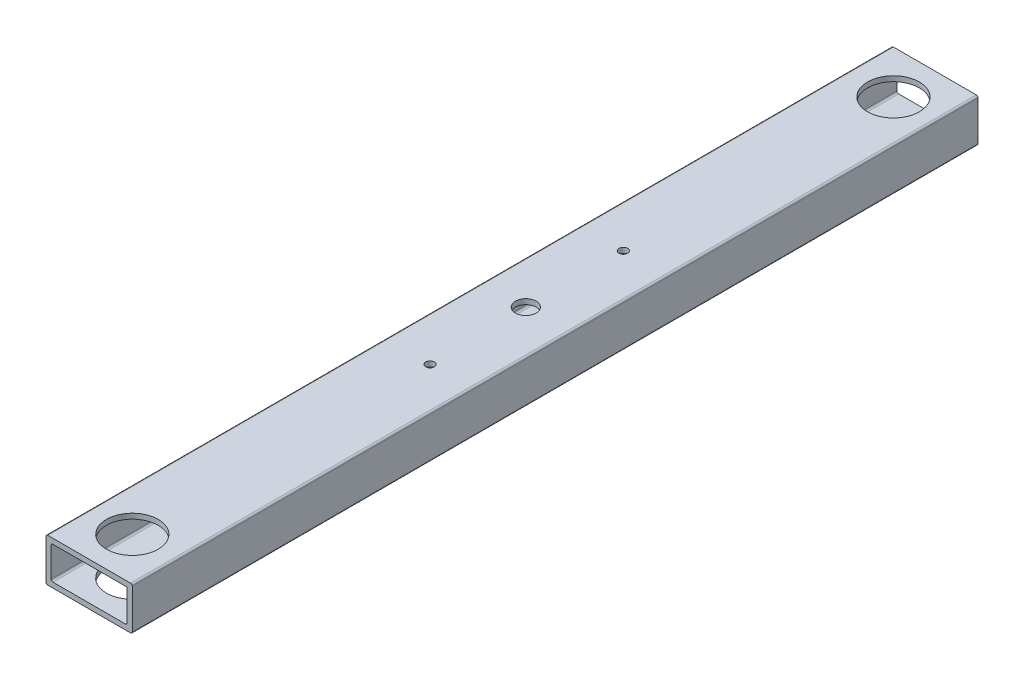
ISO-10303-21;
HEADER;
FILE_DESCRIPTION(('STEP AP214'),'2;1');
FILE_NAME('part.step','',(''),(''),'','','');
FILE_SCHEMA(('AUTOMOTIVE_DESIGN { 1 0 10303 214 1 1 1 1 }'));
ENDSEC;
DATA;
#1=APPLICATION_CONTEXT('core data for automotive mechanical design processes');
#2=APPLICATION_PROTOCOL_DEFINITION('international standard','automotive_design',2000,#1);
#3=PRODUCT_CONTEXT('',#1,'mechanical');
#4=PRODUCT('Part','Part','',(#3));
#5=PRODUCT_RELATED_PRODUCT_CATEGORY('part','',(#4));
#6=PRODUCT_DEFINITION_FORMATION('','',#4);
#7=PRODUCT_DEFINITION_CONTEXT('part definition',#1,'design');
#8=PRODUCT_DEFINITION('design','',#6,#7);
#9=PRODUCT_DEFINITION_SHAPE('','',#8);
#10=(LENGTH_UNIT() NAMED_UNIT(*) SI_UNIT(.MILLI.,.METRE.));
#11=(NAMED_UNIT(*) PLANE_ANGLE_UNIT() SI_UNIT($,.RADIAN.));
#12=(NAMED_UNIT(*) SI_UNIT($,.STERADIAN.) SOLID_ANGLE_UNIT());
#13=UNCERTAINTY_MEASURE_WITH_UNIT(LENGTH_MEASURE(1.E-05),#10,'distance_accuracy_value','');
#14=(GEOMETRIC_REPRESENTATION_CONTEXT(3) GLOBAL_UNCERTAINTY_ASSIGNED_CONTEXT((#13)) GLOBAL_UNIT_ASSIGNED_CONTEXT((#10,
#11,#12)) REPRESENTATION_CONTEXT('',''));
#15=CARTESIAN_POINT('',(0.,0.,0.));
#16=DIRECTION('',(0.,0.,1.));
#17=DIRECTION('',(1.,0.,0.));
#18=AXIS2_PLACEMENT_3D('',#15,#16,#17);
#19=CARTESIAN_POINT('',(1.,24.,490.));
#20=DIRECTION('',(0.,0.,-1.));
#21=DIRECTION('',(-1.,0.,0.));
#22=AXIS2_PLACEMENT_3D('',#19,#20,#21);
#23=PLANE('',#22);
#24=CARTESIAN_POINT('',(1.,24.,490.));
#25=DIRECTION('',(0.,0.,1.));
#26=DIRECTION('',(-1.,0.,0.));
#27=AXIS2_PLACEMENT_3D('',#24,#25,#26);
#28=CIRCLE('',#27,0.999999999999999);
#29=CARTESIAN_POINT('',(1.,25.,490.));
#30=VERTEX_POINT('',#29);
#31=CARTESIAN_POINT('',(0.,24.,490.));
#32=VERTEX_POINT('',#31);
#33=EDGE_CURVE('E218',#30,#32,#28,.T.);
#34=ORIENTED_EDGE('',*,*,#33,.T.);
#35=DIRECTION('',(0.,-1.,0.));
#36=VECTOR('',#35,1.);
#37=CARTESIAN_POINT('',(0.,1.,490.));
#38=LINE('',#37,#36);
#39=CARTESIAN_POINT('',(0.,1.,490.));
#40=VERTEX_POINT('',#39);
#41=EDGE_CURVE('E221',#32,#40,#38,.T.);
#42=ORIENTED_EDGE('',*,*,#41,.T.);
#43=CARTESIAN_POINT('',(1.,1.,490.));
#44=DIRECTION('',(0.,0.,1.));
#45=DIRECTION('',(-1.,0.,0.));
#46=AXIS2_PLACEMENT_3D('',#43,#44,#45);
#47=CIRCLE('',#46,1.);
#48=CARTESIAN_POINT('',(1.,0.,490.));
#49=VERTEX_POINT('',#48);
#50=EDGE_CURVE('E223',#40,#49,#47,.T.);
#51=ORIENTED_EDGE('',*,*,#50,.T.);
#52=DIRECTION('',(1.,0.,0.));
#53=VECTOR('',#52,1.);
#54=CARTESIAN_POINT('',(1.,0.,490.));
#55=LINE('',#54,#53);
#56=CARTESIAN_POINT('',(49.,0.,490.));
#57=VERTEX_POINT('',#56);
#58=EDGE_CURVE('E225',#49,#57,#55,.T.);
#59=ORIENTED_EDGE('',*,*,#58,.T.);
#60=CARTESIAN_POINT('',(49.,1.,490.));
#61=DIRECTION('',(0.,0.,1.));
#62=DIRECTION('',(1.,0.,0.));
#63=AXIS2_PLACEMENT_3D('',#60,#61,#62);
#64=CIRCLE('',#63,1.);
#65=CARTESIAN_POINT('',(50.,1.,490.));
#66=VERTEX_POINT('',#65);
#67=EDGE_CURVE('E227',#57,#66,#64,.T.);
#68=ORIENTED_EDGE('',*,*,#67,.T.);
#69=DIRECTION('',(0.,1.,0.));
#70=VECTOR('',#69,1.);
#71=CARTESIAN_POINT('',(50.,1.,490.));
#72=LINE('',#71,#70);
#73=CARTESIAN_POINT('',(50.,24.,490.));
#74=VERTEX_POINT('',#73);
#75=EDGE_CURVE('E229',#66,#74,#72,.T.);
#76=ORIENTED_EDGE('',*,*,#75,.T.);
#77=CARTESIAN_POINT('',(49.,24.,490.));
#78=DIRECTION('',(0.,0.,1.));
#79=DIRECTION('',(1.,0.,0.));
#80=AXIS2_PLACEMENT_3D('',#77,#78,#79);
#81=CIRCLE('',#80,0.999999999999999);
#82=CARTESIAN_POINT('',(49.,25.,490.));
#83=VERTEX_POINT('',#82);
#84=EDGE_CURVE('E231',#74,#83,#81,.T.);
#85=ORIENTED_EDGE('',*,*,#84,.T.);
#86=DIRECTION('',(-1.,0.,0.));
#87=VECTOR('',#86,1.);
#88=CARTESIAN_POINT('',(1.,25.,490.));
#89=LINE('',#88,#87);
#90=EDGE_CURVE('E233',#83,#30,#89,.T.);
#91=ORIENTED_EDGE('',*,*,#90,.T.);
#92=EDGE_LOOP('',(#34,#42,#51,#59,#68,#76,#85,#91));
#93=FACE_BOUND('',#92,.T.);
#94=DIRECTION('',(0.,1.,0.));
#95=VECTOR('',#94,1.);
#96=CARTESIAN_POINT('',(47.,4.,490.));
#97=LINE('',#96,#95);
#98=CARTESIAN_POINT('',(47.,4.,490.));
#99=VERTEX_POINT('',#98);
#100=CARTESIAN_POINT('',(47.,22.,490.));
#101=VERTEX_POINT('',#100);
#102=EDGE_CURVE('E155',#99,#101,#97,.T.);
#103=ORIENTED_EDGE('',*,*,#102,.F.);
#104=CARTESIAN_POINT('',(46.,4.,490.));
#105=DIRECTION('',(0.,0.,1.));
#106=DIRECTION('',(-1.,0.,0.));
#107=AXIS2_PLACEMENT_3D('',#104,#105,#106);
#108=CIRCLE('',#107,1.);
#109=CARTESIAN_POINT('',(46.,3.,490.));
#110=VERTEX_POINT('',#109);
#111=EDGE_CURVE('E190',#110,#99,#108,.T.);
#112=ORIENTED_EDGE('',*,*,#111,.F.);
#113=DIRECTION('',(1.,0.,0.));
#114=VECTOR('',#113,1.);
#115=CARTESIAN_POINT('',(4.,3.,490.));
#116=LINE('',#115,#114);
#117=CARTESIAN_POINT('',(4.,3.,490.));
#118=VERTEX_POINT('',#117);
#119=EDGE_CURVE('E188',#118,#110,#116,.T.);
#120=ORIENTED_EDGE('',*,*,#119,.F.);
#121=CARTESIAN_POINT('',(4.,4.,490.));
#122=DIRECTION('',(0.,0.,1.));
#123=DIRECTION('',(-1.,0.,0.));
#124=AXIS2_PLACEMENT_3D('',#121,#122,#123);
#125=CIRCLE('',#124,1.);
#126=CARTESIAN_POINT('',(3.,4.,490.));
#127=VERTEX_POINT('',#126);
#128=EDGE_CURVE('E186',#127,#118,#125,.T.);
#129=ORIENTED_EDGE('',*,*,#128,.F.);
#130=DIRECTION('',(0.,-1.,0.));
#131=VECTOR('',#130,1.);
#132=CARTESIAN_POINT('',(3.,4.,490.));
#133=LINE('',#132,#131);
#134=CARTESIAN_POINT('',(3.,21.,490.));
#135=VERTEX_POINT('',#134);
#136=EDGE_CURVE('E184',#135,#127,#133,.T.);
#137=ORIENTED_EDGE('',*,*,#136,.F.);
#138=CARTESIAN_POINT('',(4.,21.,490.));
#139=DIRECTION('',(0.,0.,1.));
#140=DIRECTION('',(-1.,0.,0.));
#141=AXIS2_PLACEMENT_3D('',#138,#139,#140);
#142=CIRCLE('',#141,1.);
#143=CARTESIAN_POINT('',(4.,22.,490.));
#144=VERTEX_POINT('',#143);
#145=EDGE_CURVE('E182',#144,#135,#142,.T.);
#146=ORIENTED_EDGE('',*,*,#145,.F.);
#147=DIRECTION('',(-1.,0.,0.));
#148=VECTOR('',#147,1.);
#149=CARTESIAN_POINT('',(4.,22.,490.));
#150=LINE('',#149,#148);
#151=EDGE_CURVE('E180',#101,#144,#150,.T.);
#152=ORIENTED_EDGE('',*,*,#151,.F.);
#153=EDGE_LOOP('',(#103,#112,#120,#129,#137,#146,#152));
#154=FACE_BOUND('',#153,.T.);
#155=ADVANCED_FACE('F31',(#93,#154),#23,.F.);
#156=CARTESIAN_POINT('',(1.,24.,0.));
#157=DIRECTION('',(0.,0.,-1.));
#158=DIRECTION('',(-1.,0.,0.));
#159=AXIS2_PLACEMENT_3D('',#156,#157,#158);
#160=PLANE('',#159);
#161=CARTESIAN_POINT('',(1.,24.,0.));
#162=DIRECTION('',(0.,0.,1.));
#163=DIRECTION('',(-1.,0.,0.));
#164=AXIS2_PLACEMENT_3D('',#161,#162,#163);
#165=CIRCLE('',#164,0.999999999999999);
#166=CARTESIAN_POINT('',(1.,25.,0.));
#167=VERTEX_POINT('',#166);
#168=CARTESIAN_POINT('',(0.,24.,0.));
#169=VERTEX_POINT('',#168);
#170=EDGE_CURVE('E156',#167,#169,#165,.T.);
#171=ORIENTED_EDGE('',*,*,#170,.F.);
#172=DIRECTION('',(-1.,0.,0.));
#173=VECTOR('',#172,1.);
#174=CARTESIAN_POINT('',(1.,25.,0.));
#175=LINE('',#174,#173);
#176=CARTESIAN_POINT('',(49.,25.,0.));
#177=VERTEX_POINT('',#176);
#178=EDGE_CURVE('E216',#177,#167,#175,.T.);
#179=ORIENTED_EDGE('',*,*,#178,.F.);
#180=CARTESIAN_POINT('',(49.,24.,0.));
#181=DIRECTION('',(0.,0.,1.));
#182=DIRECTION('',(1.,0.,0.));
#183=AXIS2_PLACEMENT_3D('',#180,#181,#182);
#184=CIRCLE('',#183,0.999999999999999);
#185=CARTESIAN_POINT('',(50.,24.,0.));
#186=VERTEX_POINT('',#185);
#187=EDGE_CURVE('E214',#186,#177,#184,.T.);
#188=ORIENTED_EDGE('',*,*,#187,.F.);
#189=DIRECTION('',(0.,1.,0.));
#190=VECTOR('',#189,1.);
#191=CARTESIAN_POINT('',(50.,1.,0.));
#192=LINE('',#191,#190);
#193=CARTESIAN_POINT('',(50.,1.,0.));
#194=VERTEX_POINT('',#193);
#195=EDGE_CURVE('E212',#194,#186,#192,.T.);
#196=ORIENTED_EDGE('',*,*,#195,.F.);
#197=CARTESIAN_POINT('',(49.,1.,0.));
#198=DIRECTION('',(0.,0.,1.));
#199=DIRECTION('',(1.,0.,0.));
#200=AXIS2_PLACEMENT_3D('',#197,#198,#199);
#201=CIRCLE('',#200,1.);
#202=CARTESIAN_POINT('',(49.,0.,0.));
#203=VERTEX_POINT('',#202);
#204=EDGE_CURVE('E210',#203,#194,#201,.T.);
#205=ORIENTED_EDGE('',*,*,#204,.F.);
#206=DIRECTION('',(1.,0.,0.));
#207=VECTOR('',#206,1.);
#208=CARTESIAN_POINT('',(1.,0.,0.));
#209=LINE('',#208,#207);
#210=CARTESIAN_POINT('',(1.,0.,0.));
#211=VERTEX_POINT('',#210);
#212=EDGE_CURVE('E208',#211,#203,#209,.T.);
#213=ORIENTED_EDGE('',*,*,#212,.F.);
#214=CARTESIAN_POINT('',(1.,1.,0.));
#215=DIRECTION('',(0.,0.,1.));
#216=DIRECTION('',(-1.,0.,0.));
#217=AXIS2_PLACEMENT_3D('',#214,#215,#216);
#218=CIRCLE('',#217,1.);
#219=CARTESIAN_POINT('',(0.,1.,0.));
#220=VERTEX_POINT('',#219);
#221=EDGE_CURVE('E206',#220,#211,#218,.T.);
#222=ORIENTED_EDGE('',*,*,#221,.F.);
#223=DIRECTION('',(0.,-1.,0.));
#224=VECTOR('',#223,1.);
#225=CARTESIAN_POINT('',(0.,1.,0.));
#226=LINE('',#225,#224);
#227=EDGE_CURVE('E204',#169,#220,#226,.T.);
#228=ORIENTED_EDGE('',*,*,#227,.F.);
#229=EDGE_LOOP('',(#171,#179,#188,#196,#205,#213,#222,#228));
#230=FACE_BOUND('',#229,.T.);
#231=CARTESIAN_POINT('',(46.,4.,0.));
#232=DIRECTION('',(0.,0.,1.));
#233=DIRECTION('',(-1.,0.,0.));
#234=AXIS2_PLACEMENT_3D('',#231,#232,#233);
#235=CIRCLE('',#234,1.);
#236=CARTESIAN_POINT('',(46.,3.,0.));
#237=VERTEX_POINT('',#236);
#238=CARTESIAN_POINT('',(47.,4.,0.));
#239=VERTEX_POINT('',#238);
#240=EDGE_CURVE('E161',#237,#239,#235,.T.);
#241=ORIENTED_EDGE('',*,*,#240,.T.);
#242=DIRECTION('',(0.,1.,0.));
#243=VECTOR('',#242,1.);
#244=CARTESIAN_POINT('',(47.,4.,0.));
#245=LINE('',#244,#243);
#246=CARTESIAN_POINT('',(47.,22.,0.));
#247=VERTEX_POINT('',#246);
#248=EDGE_CURVE('E56',#239,#247,#245,.T.);
#249=ORIENTED_EDGE('',*,*,#248,.T.);
#250=DIRECTION('',(-1.,0.,0.));
#251=VECTOR('',#250,1.);
#252=CARTESIAN_POINT('',(4.,22.,0.));
#253=LINE('',#252,#251);
#254=CARTESIAN_POINT('',(4.,22.,0.));
#255=VERTEX_POINT('',#254);
#256=EDGE_CURVE('E142',#247,#255,#253,.T.);
#257=ORIENTED_EDGE('',*,*,#256,.T.);
#258=CARTESIAN_POINT('',(4.,21.,0.));
#259=DIRECTION('',(0.,0.,1.));
#260=DIRECTION('',(-1.,0.,0.));
#261=AXIS2_PLACEMENT_3D('',#258,#259,#260);
#262=CIRCLE('',#261,1.);
#263=CARTESIAN_POINT('',(3.,21.,0.));
#264=VERTEX_POINT('',#263);
#265=EDGE_CURVE('E151',#255,#264,#262,.T.);
#266=ORIENTED_EDGE('',*,*,#265,.T.);
#267=DIRECTION('',(0.,-1.,0.));
#268=VECTOR('',#267,1.);
#269=CARTESIAN_POINT('',(3.,4.,0.));
#270=LINE('',#269,#268);
#271=CARTESIAN_POINT('',(3.,4.,0.));
#272=VERTEX_POINT('',#271);
#273=EDGE_CURVE('E170',#264,#272,#270,.T.);
#274=ORIENTED_EDGE('',*,*,#273,.T.);
#275=CARTESIAN_POINT('',(4.,4.,0.));
#276=DIRECTION('',(0.,0.,1.));
#277=DIRECTION('',(-1.,0.,0.));
#278=AXIS2_PLACEMENT_3D('',#275,#276,#277);
#279=CIRCLE('',#278,1.);
#280=CARTESIAN_POINT('',(4.,3.,0.));
#281=VERTEX_POINT('',#280);
#282=EDGE_CURVE('E173',#272,#281,#279,.T.);
#283=ORIENTED_EDGE('',*,*,#282,.T.);
#284=DIRECTION('',(1.,0.,0.));
#285=VECTOR('',#284,1.);
#286=CARTESIAN_POINT('',(4.,3.,0.));
#287=LINE('',#286,#285);
#288=EDGE_CURVE('E176',#281,#237,#287,.T.);
#289=ORIENTED_EDGE('',*,*,#288,.T.);
#290=EDGE_LOOP('',(#241,#249,#257,#266,#274,#283,#289));
#291=FACE_BOUND('',#290,.T.);
#292=ADVANCED_FACE('F159',(#230,#291),#160,.T.);
#293=CARTESIAN_POINT('',(1.,24.,490.));
#294=DIRECTION('',(0.,0.,-1.));
#295=DIRECTION('',(-1.,0.,0.));
#296=AXIS2_PLACEMENT_3D('',#293,#294,#295);
#297=CYLINDRICAL_SURFACE('',#296,0.999999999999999);
#298=ORIENTED_EDGE('',*,*,#170,.T.);
#299=DIRECTION('',(0.,0.,-1.));
#300=VECTOR('',#299,1.);
#301=CARTESIAN_POINT('',(0.,24.,490.));
#302=LINE('',#301,#300);
#303=EDGE_CURVE('E11',#32,#169,#302,.T.);
#304=ORIENTED_EDGE('',*,*,#303,.F.);
#305=ORIENTED_EDGE('',*,*,#33,.F.);
#306=DIRECTION('',(0.,0.,-1.));
#307=VECTOR('',#306,1.);
#308=CARTESIAN_POINT('',(1.,25.,490.));
#309=LINE('',#308,#307);
#310=EDGE_CURVE('E235',#30,#167,#309,.T.);
#311=ORIENTED_EDGE('',*,*,#310,.T.);
#312=EDGE_LOOP('',(#298,#304,#305,#311));
#313=FACE_BOUND('',#312,.T.);
#314=ADVANCED_FACE('F33',(#313),#297,.T.);
#315=CARTESIAN_POINT('',(0.,1.,490.));
#316=DIRECTION('',(1.,0.,0.));
#317=DIRECTION('',(0.,0.,-1.));
#318=AXIS2_PLACEMENT_3D('',#315,#316,#317);
#319=PLANE('',#318);
#320=ORIENTED_EDGE('',*,*,#227,.T.);
#321=DIRECTION('',(0.,0.,-1.));
#322=VECTOR('',#321,1.);
#323=CARTESIAN_POINT('',(0.,1.,490.));
#324=LINE('',#323,#322);
#325=EDGE_CURVE('E40',#40,#220,#324,.T.);
#326=ORIENTED_EDGE('',*,*,#325,.F.);
#327=ORIENTED_EDGE('',*,*,#41,.F.);
#328=ORIENTED_EDGE('',*,*,#303,.T.);
#329=EDGE_LOOP('',(#320,#326,#327,#328));
#330=FACE_BOUND('',#329,.T.);
#331=ADVANCED_FACE('F349',(#330),#319,.F.);
#332=CARTESIAN_POINT('',(1.,1.,490.));
#333=DIRECTION('',(0.,0.,-1.));
#334=DIRECTION('',(-1.,0.,0.));
#335=AXIS2_PLACEMENT_3D('',#332,#333,#334);
#336=CYLINDRICAL_SURFACE('',#335,1.);
#337=ORIENTED_EDGE('',*,*,#221,.T.);
#338=DIRECTION('',(0.,0.,-1.));
#339=VECTOR('',#338,1.);
#340=CARTESIAN_POINT('',(1.,0.,490.));
#341=LINE('',#340,#339);
#342=EDGE_CURVE('E250',#49,#211,#341,.T.);
#343=ORIENTED_EDGE('',*,*,#342,.F.);
#344=ORIENTED_EDGE('',*,*,#50,.F.);
#345=ORIENTED_EDGE('',*,*,#325,.T.);
#346=EDGE_LOOP('',(#337,#343,#344,#345));
#347=FACE_BOUND('',#346,.T.);
#348=ADVANCED_FACE('F346',(#347),#336,.T.);
#349=CARTESIAN_POINT('',(1.,0.,490.));
#350=DIRECTION('',(0.,1.,0.));
#351=DIRECTION('',(0.,0.,1.));
#352=AXIS2_PLACEMENT_3D('',#349,#350,#351);
#353=PLANE('',#352);
#354=CARTESIAN_POINT('',(25.0000000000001,0.,465.));
#355=DIRECTION('',(0.,1.,0.));
#356=DIRECTION('',(0.,0.,1.));
#357=AXIS2_PLACEMENT_3D('',#354,#355,#356);
#358=CIRCLE('',#357,15.);
#359=CARTESIAN_POINT('',(25.0000000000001,0.,480.));
#360=VERTEX_POINT('',#359);
#361=EDGE_CURVE('E266',#360,#360,#358,.T.);
#362=ORIENTED_EDGE('',*,*,#361,.T.);
#363=EDGE_LOOP('',(#362));
#364=FACE_BOUND('',#363,.T.);
#365=CARTESIAN_POINT('',(25.,0.,237.));
#366=DIRECTION('',(0.,1.,0.));
#367=DIRECTION('',(0.,0.,1.));
#368=AXIS2_PLACEMENT_3D('',#365,#366,#367);
#369=CIRCLE('',#368,6.00000000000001);
#370=CARTESIAN_POINT('',(25.,0.,243.));
#371=VERTEX_POINT('',#370);
#372=EDGE_CURVE('E262',#371,#371,#369,.T.);
#373=ORIENTED_EDGE('',*,*,#372,.T.);
#374=EDGE_LOOP('',(#373));
#375=FACE_BOUND('',#374,.T.);
#376=CARTESIAN_POINT('',(26.,0.,25.));
#377=DIRECTION('',(0.,1.,0.));
#378=DIRECTION('',(0.,0.,1.));
#379=AXIS2_PLACEMENT_3D('',#376,#377,#378);
#380=CIRCLE('',#379,15.);
#381=CARTESIAN_POINT('',(26.,0.,40.));
#382=VERTEX_POINT('',#381);
#383=EDGE_CURVE('E257',#382,#382,#380,.T.);
#384=ORIENTED_EDGE('',*,*,#383,.T.);
#385=EDGE_LOOP('',(#384));
#386=FACE_BOUND('',#385,.T.);
#387=ORIENTED_EDGE('',*,*,#212,.T.);
#388=DIRECTION('',(0.,0.,-1.));
#389=VECTOR('',#388,1.);
#390=CARTESIAN_POINT('',(49.,0.,490.));
#391=LINE('',#390,#389);
#392=EDGE_CURVE('E247',#57,#203,#391,.T.);
#393=ORIENTED_EDGE('',*,*,#392,.F.);
#394=ORIENTED_EDGE('',*,*,#58,.F.);
#395=ORIENTED_EDGE('',*,*,#342,.T.);
#396=EDGE_LOOP('',(#387,#393,#394,#395));
#397=FACE_BOUND('',#396,.T.);
#398=ADVANCED_FACE('F299',(#364,#375,#386,#397),#353,.F.);
#399=CARTESIAN_POINT('',(49.,1.,490.));
#400=DIRECTION('',(0.,0.,-1.));
#401=DIRECTION('',(-1.,0.,0.));
#402=AXIS2_PLACEMENT_3D('',#399,#400,#401);
#403=CYLINDRICAL_SURFACE('',#402,1.);
#404=ORIENTED_EDGE('',*,*,#204,.T.);
#405=DIRECTION('',(0.,0.,-1.));
#406=VECTOR('',#405,1.);
#407=CARTESIAN_POINT('',(50.,1.,490.));
#408=LINE('',#407,#406);
#409=EDGE_CURVE('E244',#66,#194,#408,.T.);
#410=ORIENTED_EDGE('',*,*,#409,.F.);
#411=ORIENTED_EDGE('',*,*,#67,.F.);
#412=ORIENTED_EDGE('',*,*,#392,.T.);
#413=EDGE_LOOP('',(#404,#410,#411,#412));
#414=FACE_BOUND('',#413,.T.);
#415=ADVANCED_FACE('F339',(#414),#403,.T.);
#416=CARTESIAN_POINT('',(50.,1.,490.));
#417=DIRECTION('',(-1.,0.,0.));
#418=DIRECTION('',(0.,0.,1.));
#419=AXIS2_PLACEMENT_3D('',#416,#417,#418);
#420=PLANE('',#419);
#421=ORIENTED_EDGE('',*,*,#195,.T.);
#422=DIRECTION('',(0.,0.,-1.));
#423=VECTOR('',#422,1.);
#424=CARTESIAN_POINT('',(50.,24.,490.));
#425=LINE('',#424,#423);
#426=EDGE_CURVE('E241',#74,#186,#425,.T.);
#427=ORIENTED_EDGE('',*,*,#426,.F.);
#428=ORIENTED_EDGE('',*,*,#75,.F.);
#429=ORIENTED_EDGE('',*,*,#409,.T.);
#430=EDGE_LOOP('',(#421,#427,#428,#429));
#431=FACE_BOUND('',#430,.T.);
#432=ADVANCED_FACE('F335',(#431),#420,.F.);
#433=CARTESIAN_POINT('',(49.,24.,490.));
#434=DIRECTION('',(0.,0.,-1.));
#435=DIRECTION('',(-1.,0.,0.));
#436=AXIS2_PLACEMENT_3D('',#433,#434,#435);
#437=CYLINDRICAL_SURFACE('',#436,0.999999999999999);
#438=ORIENTED_EDGE('',*,*,#187,.T.);
#439=DIRECTION('',(0.,0.,-1.));
#440=VECTOR('',#439,1.);
#441=CARTESIAN_POINT('',(49.,25.,490.));
#442=LINE('',#441,#440);
#443=EDGE_CURVE('E238',#83,#177,#442,.T.);
#444=ORIENTED_EDGE('',*,*,#443,.F.);
#445=ORIENTED_EDGE('',*,*,#84,.F.);
#446=ORIENTED_EDGE('',*,*,#426,.T.);
#447=EDGE_LOOP('',(#438,#444,#445,#446));
#448=FACE_BOUND('',#447,.T.);
#449=ADVANCED_FACE('F331',(#448),#437,.T.);
#450=CARTESIAN_POINT('',(1.,25.,490.));
#451=DIRECTION('',(0.,-1.,0.));
#452=DIRECTION('',(0.,0.,-1.));
#453=AXIS2_PLACEMENT_3D('',#450,#451,#452);
#454=PLANE('',#453);
#455=CARTESIAN_POINT('',(25.,25.,180.5));
#456=DIRECTION('',(0.,1.,0.));
#457=DIRECTION('',(0.,0.,1.));
#458=AXIS2_PLACEMENT_3D('',#455,#456,#457);
#459=CIRCLE('',#458,2.49999999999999);
#460=CARTESIAN_POINT('',(25.,25.,183.));
#461=VERTEX_POINT('',#460);
#462=EDGE_CURVE('E280',#461,#461,#459,.T.);
#463=ORIENTED_EDGE('',*,*,#462,.F.);
#464=EDGE_LOOP('',(#463));
#465=FACE_BOUND('',#464,.T.);
#466=CARTESIAN_POINT('',(26.,25.,293.495575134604));
#467=DIRECTION('',(0.,1.,0.));
#468=DIRECTION('',(0.,0.,1.));
#469=AXIS2_PLACEMENT_3D('',#466,#467,#468);
#470=CIRCLE('',#469,2.49999999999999);
#471=CARTESIAN_POINT('',(26.,25.,295.995575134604));
#472=VERTEX_POINT('',#471);
#473=EDGE_CURVE('E270',#472,#472,#470,.T.);
#474=ORIENTED_EDGE('',*,*,#473,.F.);
#475=EDGE_LOOP('',(#474));
#476=FACE_BOUND('',#475,.T.);
#477=CARTESIAN_POINT('',(25.0000000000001,25.,465.));
#478=DIRECTION('',(0.,1.,0.));
#479=DIRECTION('',(0.,0.,1.));
#480=AXIS2_PLACEMENT_3D('',#477,#478,#479);
#481=CIRCLE('',#480,15.);
#482=CARTESIAN_POINT('',(25.0000000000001,25.,480.));
#483=VERTEX_POINT('',#482);
#484=EDGE_CURVE('E269',#483,#483,#481,.T.);
#485=ORIENTED_EDGE('',*,*,#484,.F.);
#486=EDGE_LOOP('',(#485));
#487=FACE_BOUND('',#486,.T.);
#488=CARTESIAN_POINT('',(25.,25.,237.));
#489=DIRECTION('',(0.,1.,0.));
#490=DIRECTION('',(0.,0.,1.));
#491=AXIS2_PLACEMENT_3D('',#488,#489,#490);
#492=CIRCLE('',#491,6.00000000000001);
#493=CARTESIAN_POINT('',(25.,25.,243.));
#494=VERTEX_POINT('',#493);
#495=EDGE_CURVE('E287',#494,#494,#492,.T.);
#496=ORIENTED_EDGE('',*,*,#495,.F.);
#497=EDGE_LOOP('',(#496));
#498=FACE_BOUND('',#497,.T.);
#499=CARTESIAN_POINT('',(26.,25.,25.));
#500=DIRECTION('',(0.,1.,0.));
#501=DIRECTION('',(0.,0.,1.));
#502=AXIS2_PLACEMENT_3D('',#499,#500,#501);
#503=CIRCLE('',#502,15.);
#504=CARTESIAN_POINT('',(26.,25.,40.));
#505=VERTEX_POINT('',#504);
#506=EDGE_CURVE('E294',#505,#505,#503,.T.);
#507=ORIENTED_EDGE('',*,*,#506,.F.);
#508=EDGE_LOOP('',(#507));
#509=FACE_BOUND('',#508,.T.);
#510=ORIENTED_EDGE('',*,*,#178,.T.);
#511=ORIENTED_EDGE('',*,*,#310,.F.);
#512=ORIENTED_EDGE('',*,*,#90,.F.);
#513=ORIENTED_EDGE('',*,*,#443,.T.);
#514=EDGE_LOOP('',(#510,#511,#512,#513));
#515=FACE_BOUND('',#514,.T.);
#516=ADVANCED_FACE('F328',(#465,#476,#487,#498,#509,#515),#454,.F.);
#517=CARTESIAN_POINT('',(47.,4.,490.));
#518=DIRECTION('',(-1.,0.,0.));
#519=DIRECTION('',(0.,0.,1.));
#520=AXIS2_PLACEMENT_3D('',#517,#518,#519);
#521=PLANE('',#520);
#522=ORIENTED_EDGE('',*,*,#248,.F.);
#523=DIRECTION('',(0.,0.,-1.));
#524=VECTOR('',#523,1.);
#525=CARTESIAN_POINT('',(47.,4.,490.));
#526=LINE('',#525,#524);
#527=EDGE_CURVE('E192',#99,#239,#526,.T.);
#528=ORIENTED_EDGE('',*,*,#527,.F.);
#529=ORIENTED_EDGE('',*,*,#102,.T.);
#530=DIRECTION('',(0.,0.,-1.));
#531=VECTOR('',#530,1.);
#532=CARTESIAN_POINT('',(47.,22.,490.));
#533=LINE('',#532,#531);
#534=EDGE_CURVE('E144',#101,#247,#533,.T.);
#535=ORIENTED_EDGE('',*,*,#534,.T.);
#536=EDGE_LOOP('',(#522,#528,#529,#535));
#537=FACE_BOUND('',#536,.T.);
#538=ADVANCED_FACE('F153',(#537),#521,.T.);
#539=CARTESIAN_POINT('',(4.,22.,490.));
#540=DIRECTION('',(0.,-1.,0.));
#541=DIRECTION('',(0.,0.,-1.));
#542=AXIS2_PLACEMENT_3D('',#539,#540,#541);
#543=PLANE('',#542);
#544=CARTESIAN_POINT('',(25.,22.,180.5));
#545=DIRECTION('',(0.,-1.,0.));
#546=DIRECTION('',(0.,0.,-1.));
#547=AXIS2_PLACEMENT_3D('',#544,#545,#546);
#548=CIRCLE('',#547,2.5);
#549=CARTESIAN_POINT('',(25.,22.,178.));
#550=VERTEX_POINT('',#549);
#551=EDGE_CURVE('E35',#550,#550,#548,.T.);
#552=ORIENTED_EDGE('',*,*,#551,.F.);
#553=EDGE_LOOP('',(#552));
#554=FACE_BOUND('',#553,.T.);
#555=CARTESIAN_POINT('',(26.,22.,293.495575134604));
#556=DIRECTION('',(0.,-1.,0.));
#557=DIRECTION('',(0.,0.,-1.));
#558=AXIS2_PLACEMENT_3D('',#555,#556,#557);
#559=CIRCLE('',#558,2.49999999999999);
#560=CARTESIAN_POINT('',(26.,22.,290.995575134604));
#561=VERTEX_POINT('',#560);
#562=EDGE_CURVE('E267',#561,#561,#559,.T.);
#563=ORIENTED_EDGE('',*,*,#562,.F.);
#564=EDGE_LOOP('',(#563));
#565=FACE_BOUND('',#564,.T.);
#566=CARTESIAN_POINT('',(25.0000000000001,22.,465.));
#567=DIRECTION('',(0.,-1.,0.));
#568=DIRECTION('',(0.,0.,-1.));
#569=AXIS2_PLACEMENT_3D('',#566,#567,#568);
#570=CIRCLE('',#569,15.);
#571=CARTESIAN_POINT('',(25.0000000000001,22.,450.));
#572=VERTEX_POINT('',#571);
#573=EDGE_CURVE('E265',#572,#572,#570,.T.);
#574=ORIENTED_EDGE('',*,*,#573,.F.);
#575=EDGE_LOOP('',(#574));
#576=FACE_BOUND('',#575,.T.);
#577=CARTESIAN_POINT('',(25.,22.,237.));
#578=DIRECTION('',(0.,-1.,0.));
#579=DIRECTION('',(0.,0.,-1.));
#580=AXIS2_PLACEMENT_3D('',#577,#578,#579);
#581=CIRCLE('',#580,6.00000000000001);
#582=CARTESIAN_POINT('',(25.,22.,231.));
#583=VERTEX_POINT('',#582);
#584=EDGE_CURVE('E261',#583,#583,#581,.T.);
#585=ORIENTED_EDGE('',*,*,#584,.F.);
#586=EDGE_LOOP('',(#585));
#587=FACE_BOUND('',#586,.T.);
#588=CARTESIAN_POINT('',(26.,22.,25.));
#589=DIRECTION('',(0.,-1.,0.));
#590=DIRECTION('',(0.,0.,-1.));
#591=AXIS2_PLACEMENT_3D('',#588,#589,#590);
#592=CIRCLE('',#591,15.);
#593=CARTESIAN_POINT('',(26.,22.,10.));
#594=VERTEX_POINT('',#593);
#595=EDGE_CURVE('E162',#594,#594,#592,.T.);
#596=ORIENTED_EDGE('',*,*,#595,.F.);
#597=EDGE_LOOP('',(#596));
#598=FACE_BOUND('',#597,.T.);
#599=ORIENTED_EDGE('',*,*,#256,.F.);
#600=ORIENTED_EDGE('',*,*,#534,.F.);
#601=ORIENTED_EDGE('',*,*,#151,.T.);
#602=DIRECTION('',(0.,0.,-1.));
#603=VECTOR('',#602,1.);
#604=CARTESIAN_POINT('',(4.,22.,490.));
#605=LINE('',#604,#603);
#606=EDGE_CURVE('E147',#144,#255,#605,.T.);
#607=ORIENTED_EDGE('',*,*,#606,.T.);
#608=EDGE_LOOP('',(#599,#600,#601,#607));
#609=FACE_BOUND('',#608,.T.);
#610=ADVANCED_FACE('F143',(#554,#565,#576,#587,#598,#609),#543,.T.);
#611=CARTESIAN_POINT('',(4.,21.,490.));
#612=DIRECTION('',(0.,0.,-1.));
#613=DIRECTION('',(-1.,0.,0.));
#614=AXIS2_PLACEMENT_3D('',#611,#612,#613);
#615=CYLINDRICAL_SURFACE('',#614,1.);
#616=ORIENTED_EDGE('',*,*,#265,.F.);
#617=ORIENTED_EDGE('',*,*,#606,.F.);
#618=ORIENTED_EDGE('',*,*,#145,.T.);
#619=DIRECTION('',(0.,0.,-1.));
#620=VECTOR('',#619,1.);
#621=CARTESIAN_POINT('',(3.,21.,490.));
#622=LINE('',#621,#620);
#623=EDGE_CURVE('E199',#135,#264,#622,.T.);
#624=ORIENTED_EDGE('',*,*,#623,.T.);
#625=EDGE_LOOP('',(#616,#617,#618,#624));
#626=FACE_BOUND('',#625,.T.);
#627=ADVANCED_FACE('F446',(#626),#615,.F.);
#628=CARTESIAN_POINT('',(3.,4.,490.));
#629=DIRECTION('',(1.,0.,0.));
#630=DIRECTION('',(0.,0.,-1.));
#631=AXIS2_PLACEMENT_3D('',#628,#629,#630);
#632=PLANE('',#631);
#633=ORIENTED_EDGE('',*,*,#273,.F.);
#634=ORIENTED_EDGE('',*,*,#623,.F.);
#635=ORIENTED_EDGE('',*,*,#136,.T.);
#636=DIRECTION('',(0.,0.,-1.));
#637=VECTOR('',#636,1.);
#638=CARTESIAN_POINT('',(3.,4.,490.));
#639=LINE('',#638,#637);
#640=EDGE_CURVE('E197',#127,#272,#639,.T.);
#641=ORIENTED_EDGE('',*,*,#640,.T.);
#642=EDGE_LOOP('',(#633,#634,#635,#641));
#643=FACE_BOUND('',#642,.T.);
#644=ADVANCED_FACE('F455',(#643),#632,.T.);
#645=CARTESIAN_POINT('',(4.,4.,490.));
#646=DIRECTION('',(0.,0.,-1.));
#647=DIRECTION('',(-1.,0.,0.));
#648=AXIS2_PLACEMENT_3D('',#645,#646,#647);
#649=CYLINDRICAL_SURFACE('',#648,1.);
#650=ORIENTED_EDGE('',*,*,#282,.F.);
#651=ORIENTED_EDGE('',*,*,#640,.F.);
#652=ORIENTED_EDGE('',*,*,#128,.T.);
#653=DIRECTION('',(0.,0.,-1.));
#654=VECTOR('',#653,1.);
#655=CARTESIAN_POINT('',(4.,3.,490.));
#656=LINE('',#655,#654);
#657=EDGE_CURVE('E195',#118,#281,#656,.T.);
#658=ORIENTED_EDGE('',*,*,#657,.T.);
#659=EDGE_LOOP('',(#650,#651,#652,#658));
#660=FACE_BOUND('',#659,.T.);
#661=ADVANCED_FACE('F464',(#660),#649,.F.);
#662=CARTESIAN_POINT('',(4.,3.,490.));
#663=DIRECTION('',(0.,1.,0.));
#664=DIRECTION('',(0.,0.,1.));
#665=AXIS2_PLACEMENT_3D('',#662,#663,#664);
#666=PLANE('',#665);
#667=CARTESIAN_POINT('',(25.0000000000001,3.,465.));
#668=DIRECTION('',(0.,1.,0.));
#669=DIRECTION('',(0.,0.,1.));
#670=AXIS2_PLACEMENT_3D('',#667,#668,#669);
#671=CIRCLE('',#670,15.);
#672=CARTESIAN_POINT('',(25.0000000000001,3.,480.));
#673=VERTEX_POINT('',#672);
#674=EDGE_CURVE('E263',#673,#673,#671,.T.);
#675=ORIENTED_EDGE('',*,*,#674,.F.);
#676=EDGE_LOOP('',(#675));
#677=FACE_BOUND('',#676,.T.);
#678=CARTESIAN_POINT('',(25.,3.,237.));
#679=DIRECTION('',(0.,1.,0.));
#680=DIRECTION('',(0.,0.,1.));
#681=AXIS2_PLACEMENT_3D('',#678,#679,#680);
#682=CIRCLE('',#681,6.00000000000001);
#683=CARTESIAN_POINT('',(25.,3.,243.));
#684=VERTEX_POINT('',#683);
#685=EDGE_CURVE('E258',#684,#684,#682,.T.);
#686=ORIENTED_EDGE('',*,*,#685,.F.);
#687=EDGE_LOOP('',(#686));
#688=FACE_BOUND('',#687,.T.);
#689=CARTESIAN_POINT('',(26.,3.,25.));
#690=DIRECTION('',(0.,1.,0.));
#691=DIRECTION('',(0.,0.,1.));
#692=AXIS2_PLACEMENT_3D('',#689,#690,#691);
#693=CIRCLE('',#692,15.);
#694=CARTESIAN_POINT('',(26.,3.,40.));
#695=VERTEX_POINT('',#694);
#696=EDGE_CURVE('E165',#695,#695,#693,.T.);
#697=ORIENTED_EDGE('',*,*,#696,.F.);
#698=EDGE_LOOP('',(#697));
#699=FACE_BOUND('',#698,.T.);
#700=ORIENTED_EDGE('',*,*,#288,.F.);
#701=ORIENTED_EDGE('',*,*,#657,.F.);
#702=ORIENTED_EDGE('',*,*,#119,.T.);
#703=DIRECTION('',(0.,0.,-1.));
#704=VECTOR('',#703,1.);
#705=CARTESIAN_POINT('',(46.,3.,490.));
#706=LINE('',#705,#704);
#707=EDGE_CURVE('E48',#110,#237,#706,.T.);
#708=ORIENTED_EDGE('',*,*,#707,.T.);
#709=EDGE_LOOP('',(#700,#701,#702,#708));
#710=FACE_BOUND('',#709,.T.);
#711=ADVANCED_FACE('F314',(#677,#688,#699,#710),#666,.T.);
#712=CARTESIAN_POINT('',(46.,4.,490.));
#713=DIRECTION('',(0.,0.,-1.));
#714=DIRECTION('',(-1.,0.,0.));
#715=AXIS2_PLACEMENT_3D('',#712,#713,#714);
#716=CYLINDRICAL_SURFACE('',#715,1.);
#717=ORIENTED_EDGE('',*,*,#240,.F.);
#718=ORIENTED_EDGE('',*,*,#707,.F.);
#719=ORIENTED_EDGE('',*,*,#111,.T.);
#720=ORIENTED_EDGE('',*,*,#527,.T.);
#721=EDGE_LOOP('',(#717,#718,#719,#720));
#722=FACE_BOUND('',#721,.T.);
#723=ADVANCED_FACE('F305',(#722),#716,.F.);
#724=CARTESIAN_POINT('',(26.,0.,25.));
#725=DIRECTION('',(0.,1.,0.));
#726=DIRECTION('',(0.,0.,1.));
#727=AXIS2_PLACEMENT_3D('',#724,#725,#726);
#728=CYLINDRICAL_SURFACE('',#727,15.);
#729=ORIENTED_EDGE('',*,*,#696,.T.);
#730=EDGE_LOOP('',(#729));
#731=FACE_BOUND('',#730,.T.);
#732=ORIENTED_EDGE('',*,*,#383,.F.);
#733=EDGE_LOOP('',(#732));
#734=FACE_BOUND('',#733,.T.);
#735=ADVANCED_FACE('F302',(#731,#734),#728,.F.);
#736=ORIENTED_EDGE('',*,*,#595,.T.);
#737=EDGE_LOOP('',(#736));
#738=FACE_BOUND('',#737,.T.);
#739=ORIENTED_EDGE('',*,*,#506,.T.);
#740=EDGE_LOOP('',(#739));
#741=FACE_BOUND('',#740,.T.);
#742=ADVANCED_FACE('F304',(#738,#741),#728,.F.);
#743=CARTESIAN_POINT('',(25.,0.,237.));
#744=DIRECTION('',(0.,1.,0.));
#745=DIRECTION('',(0.,0.,1.));
#746=AXIS2_PLACEMENT_3D('',#743,#744,#745);
#747=CYLINDRICAL_SURFACE('',#746,6.00000000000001);
#748=ORIENTED_EDGE('',*,*,#685,.T.);
#749=EDGE_LOOP('',(#748));
#750=FACE_BOUND('',#749,.T.);
#751=ORIENTED_EDGE('',*,*,#372,.F.);
#752=EDGE_LOOP('',(#751));
#753=FACE_BOUND('',#752,.T.);
#754=ADVANCED_FACE('F312',(#750,#753),#747,.F.);
#755=ORIENTED_EDGE('',*,*,#584,.T.);
#756=EDGE_LOOP('',(#755));
#757=FACE_BOUND('',#756,.T.);
#758=ORIENTED_EDGE('',*,*,#495,.T.);
#759=EDGE_LOOP('',(#758));
#760=FACE_BOUND('',#759,.T.);
#761=ADVANCED_FACE('F501',(#757,#760),#747,.F.);
#762=CARTESIAN_POINT('',(25.0000000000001,0.,465.));
#763=DIRECTION('',(0.,1.,0.));
#764=DIRECTION('',(0.,0.,1.));
#765=AXIS2_PLACEMENT_3D('',#762,#763,#764);
#766=CYLINDRICAL_SURFACE('',#765,15.);
#767=ORIENTED_EDGE('',*,*,#674,.T.);
#768=EDGE_LOOP('',(#767));
#769=FACE_BOUND('',#768,.T.);
#770=ORIENTED_EDGE('',*,*,#361,.F.);
#771=EDGE_LOOP('',(#770));
#772=FACE_BOUND('',#771,.T.);
#773=ADVANCED_FACE('F509',(#769,#772),#766,.F.);
#774=ORIENTED_EDGE('',*,*,#573,.T.);
#775=EDGE_LOOP('',(#774));
#776=FACE_BOUND('',#775,.T.);
#777=ORIENTED_EDGE('',*,*,#484,.T.);
#778=EDGE_LOOP('',(#777));
#779=FACE_BOUND('',#778,.T.);
#780=ADVANCED_FACE('F517',(#776,#779),#766,.F.);
#781=CARTESIAN_POINT('',(26.,25.,293.495575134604));
#782=DIRECTION('',(0.,1.,0.));
#783=DIRECTION('',(0.,0.,1.));
#784=AXIS2_PLACEMENT_3D('',#781,#782,#783);
#785=CYLINDRICAL_SURFACE('',#784,2.49999999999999);
#786=ORIENTED_EDGE('',*,*,#562,.T.);
#787=EDGE_LOOP('',(#786));
#788=FACE_BOUND('',#787,.T.);
#789=ORIENTED_EDGE('',*,*,#473,.T.);
#790=EDGE_LOOP('',(#789));
#791=FACE_BOUND('',#790,.T.);
#792=ADVANCED_FACE('F525',(#788,#791),#785,.F.);
#793=CARTESIAN_POINT('',(25.,25.,180.5));
#794=DIRECTION('',(0.,1.,0.));
#795=DIRECTION('',(0.,0.,1.));
#796=AXIS2_PLACEMENT_3D('',#793,#794,#795);
#797=CYLINDRICAL_SURFACE('',#796,2.5);
#798=ORIENTED_EDGE('',*,*,#551,.T.);
#799=EDGE_LOOP('',(#798));
#800=FACE_BOUND('',#799,.T.);
#801=ORIENTED_EDGE('',*,*,#462,.T.);
#802=EDGE_LOOP('',(#801));
#803=FACE_BOUND('',#802,.T.);
#804=ADVANCED_FACE('F532',(#800,#803),#797,.F.);
#805=CLOSED_SHELL('',(#155,#292,#314,#331,#348,#398,#415,#432,#449,#516,#538,#610,#627,#644,
#661,#711,#723,#735,#742,#754,#761,#773,#780,#792,#804));
#806=MANIFOLD_SOLID_BREP('B2',#805);
#807=ADVANCED_BREP_SHAPE_REPRESENTATION('',(#18,#806),#14);
#808=SHAPE_DEFINITION_REPRESENTATION(#9,#807);
ENDSEC;
END-ISO-10303-21;
